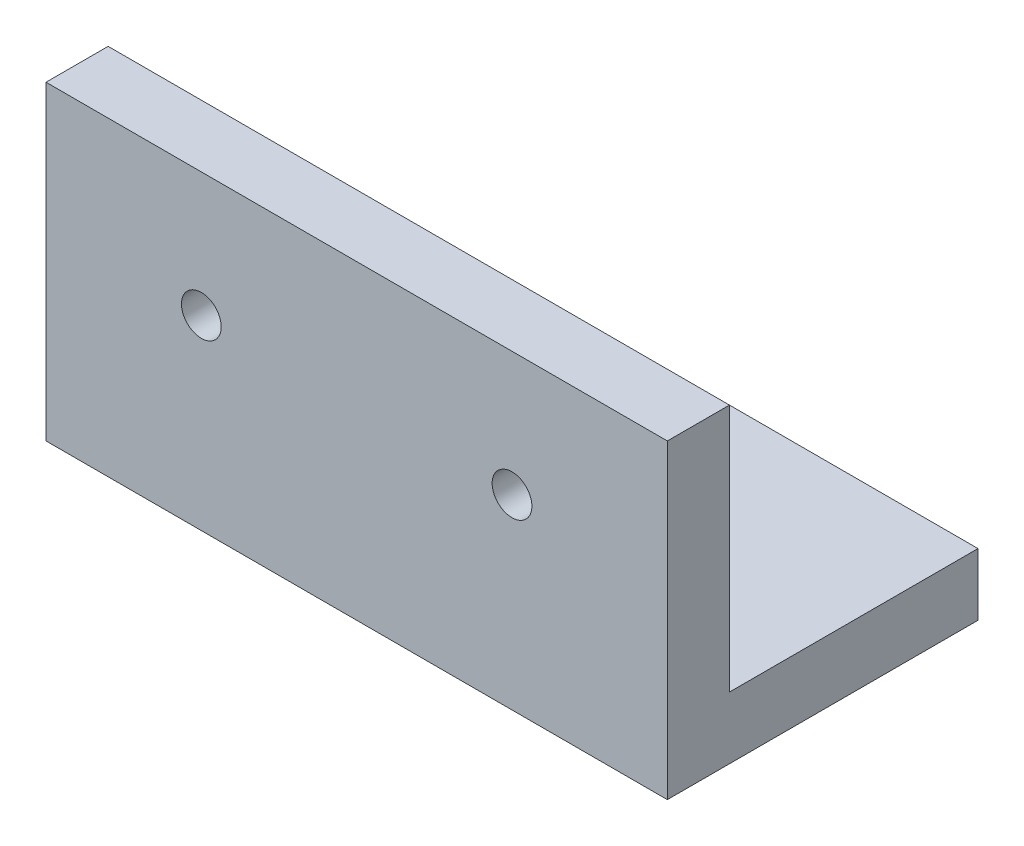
ISO-10303-21;
HEADER;
FILE_DESCRIPTION(('STEP AP214'),'2;1');
FILE_NAME('part.step','',(''),(''),'','','');
FILE_SCHEMA(('AUTOMOTIVE_DESIGN { 1 0 10303 214 1 1 1 1 }'));
ENDSEC;
DATA;
#1=APPLICATION_CONTEXT('core data for automotive mechanical design processes');
#2=APPLICATION_PROTOCOL_DEFINITION('international standard','automotive_design',2000,#1);
#3=PRODUCT_CONTEXT('',#1,'mechanical');
#4=PRODUCT('Part','Part','',(#3));
#5=PRODUCT_RELATED_PRODUCT_CATEGORY('part','',(#4));
#6=PRODUCT_DEFINITION_FORMATION('','',#4);
#7=PRODUCT_DEFINITION_CONTEXT('part definition',#1,'design');
#8=PRODUCT_DEFINITION('design','',#6,#7);
#9=PRODUCT_DEFINITION_SHAPE('','',#8);
#10=(LENGTH_UNIT() NAMED_UNIT(*) SI_UNIT(.MILLI.,.METRE.));
#11=(NAMED_UNIT(*) PLANE_ANGLE_UNIT() SI_UNIT($,.RADIAN.));
#12=(NAMED_UNIT(*) SI_UNIT($,.STERADIAN.) SOLID_ANGLE_UNIT());
#13=UNCERTAINTY_MEASURE_WITH_UNIT(LENGTH_MEASURE(1.E-05),#10,'distance_accuracy_value','');
#14=(GEOMETRIC_REPRESENTATION_CONTEXT(3) GLOBAL_UNCERTAINTY_ASSIGNED_CONTEXT((#13)) GLOBAL_UNIT_ASSIGNED_CONTEXT((#10,
#11,#12)) REPRESENTATION_CONTEXT('',''));
#15=CARTESIAN_POINT('',(0.,0.,0.));
#16=DIRECTION('',(0.,0.,1.));
#17=DIRECTION('',(1.,0.,0.));
#18=AXIS2_PLACEMENT_3D('',#15,#16,#17);
#19=CARTESIAN_POINT('',(0.,5.,0.));
#20=DIRECTION('',(0.,-1.,0.));
#21=DIRECTION('',(0.,0.,-1.));
#22=AXIS2_PLACEMENT_3D('',#19,#20,#21);
#23=PLANE('',#22);
#24=CARTESIAN_POINT('',(18.9814814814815,5.,-15.));
#25=DIRECTION('',(0.,-1.,0.));
#26=DIRECTION('',(0.,0.,1.));
#27=AXIS2_PLACEMENT_3D('',#24,#25,#26);
#28=CIRCLE('',#27,1.6);
#29=CARTESIAN_POINT('',(18.9814814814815,5.,-13.4));
#30=VERTEX_POINT('',#29);
#31=EDGE_CURVE('E150',#30,#30,#28,.T.);
#32=ORIENTED_EDGE('',*,*,#31,.T.);
#33=EDGE_LOOP('',(#32));
#34=FACE_BOUND('',#33,.T.);
#35=CARTESIAN_POINT('',(-6.01851851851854,5.,-15.));
#36=DIRECTION('',(0.,1.,0.));
#37=DIRECTION('',(0.,0.,1.));
#38=AXIS2_PLACEMENT_3D('',#35,#36,#37);
#39=CIRCLE('',#38,1.6);
#40=CARTESIAN_POINT('',(-6.01851851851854,5.,-13.4));
#41=VERTEX_POINT('',#40);
#42=EDGE_CURVE('E144',#41,#41,#39,.T.);
#43=ORIENTED_EDGE('',*,*,#42,.F.);
#44=EDGE_LOOP('',(#43));
#45=FACE_BOUND('',#44,.T.);
#46=DIRECTION('',(-1.,0.,0.));
#47=VECTOR('',#46,1.);
#48=CARTESIAN_POINT('',(31.4814814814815,5.,-5.));
#49=LINE('',#48,#47);
#50=CARTESIAN_POINT('',(31.4814814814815,5.,-5.));
#51=VERTEX_POINT('',#50);
#52=CARTESIAN_POINT('',(-18.5185185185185,5.,-4.99999999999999));
#53=VERTEX_POINT('',#52);
#54=EDGE_CURVE('E48',#51,#53,#49,.T.);
#55=ORIENTED_EDGE('',*,*,#54,.F.);
#56=DIRECTION('',(0.,0.,-1.));
#57=VECTOR('',#56,1.);
#58=CARTESIAN_POINT('',(31.4814814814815,5.,0.));
#59=LINE('',#58,#57);
#60=CARTESIAN_POINT('',(31.4814814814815,5.,-25.));
#61=VERTEX_POINT('',#60);
#62=EDGE_CURVE('E134',#51,#61,#59,.T.);
#63=ORIENTED_EDGE('',*,*,#62,.T.);
#64=DIRECTION('',(-1.,0.,0.));
#65=VECTOR('',#64,1.);
#66=CARTESIAN_POINT('',(-18.5185185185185,5.,-25.));
#67=LINE('',#66,#65);
#68=CARTESIAN_POINT('',(-18.5185185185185,5.,-25.));
#69=VERTEX_POINT('',#68);
#70=EDGE_CURVE('E54',#61,#69,#67,.T.);
#71=ORIENTED_EDGE('',*,*,#70,.T.);
#72=DIRECTION('',(0.,0.,1.));
#73=VECTOR('',#72,1.);
#74=CARTESIAN_POINT('',(-18.5185185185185,5.,0.));
#75=LINE('',#74,#73);
#76=EDGE_CURVE('E83',#69,#53,#75,.T.);
#77=ORIENTED_EDGE('',*,*,#76,.T.);
#78=EDGE_LOOP('',(#55,#63,#71,#77));
#79=FACE_BOUND('',#78,.T.);
#80=ADVANCED_FACE('F33',(#34,#45,#79),#23,.F.);
#81=CARTESIAN_POINT('',(-18.5185185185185,5.,0.));
#82=DIRECTION('',(1.,0.,0.));
#83=DIRECTION('',(0.,0.,-1.));
#84=AXIS2_PLACEMENT_3D('',#81,#82,#83);
#85=PLANE('',#84);
#86=DIRECTION('',(0.,0.,1.));
#87=VECTOR('',#86,1.);
#88=CARTESIAN_POINT('',(-18.5185185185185,0.,0.));
#89=LINE('',#88,#87);
#90=CARTESIAN_POINT('',(-18.5185185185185,0.,-25.));
#91=VERTEX_POINT('',#90);
#92=CARTESIAN_POINT('',(-18.5185185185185,0.,0.));
#93=VERTEX_POINT('',#92);
#94=EDGE_CURVE('E89',#91,#93,#89,.T.);
#95=ORIENTED_EDGE('',*,*,#94,.T.);
#96=DIRECTION('',(0.,-1.,0.));
#97=VECTOR('',#96,1.);
#98=CARTESIAN_POINT('',(-18.5185185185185,5.,0.));
#99=LINE('',#98,#97);
#100=CARTESIAN_POINT('',(-18.5185185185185,25.,0.));
#101=VERTEX_POINT('',#100);
#102=EDGE_CURVE('E11',#101,#93,#99,.T.);
#103=ORIENTED_EDGE('',*,*,#102,.F.);
#104=DIRECTION('',(0.,0.,1.));
#105=VECTOR('',#104,1.);
#106=CARTESIAN_POINT('',(-18.5185185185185,25.,0.));
#107=LINE('',#106,#105);
#108=CARTESIAN_POINT('',(-18.5185185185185,25.,-4.99999999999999));
#109=VERTEX_POINT('',#108);
#110=EDGE_CURVE('E125',#109,#101,#107,.T.);
#111=ORIENTED_EDGE('',*,*,#110,.F.);
#112=DIRECTION('',(0.,-1.,0.));
#113=VECTOR('',#112,1.);
#114=CARTESIAN_POINT('',(-18.5185185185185,25.,-4.99999999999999));
#115=LINE('',#114,#113);
#116=EDGE_CURVE('E98',#109,#53,#115,.T.);
#117=ORIENTED_EDGE('',*,*,#116,.T.);
#118=ORIENTED_EDGE('',*,*,#76,.F.);
#119=DIRECTION('',(0.,-1.,0.));
#120=VECTOR('',#119,1.);
#121=CARTESIAN_POINT('',(-18.5185185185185,5.,-25.));
#122=LINE('',#121,#120);
#123=EDGE_CURVE('E76',#69,#91,#122,.T.);
#124=ORIENTED_EDGE('',*,*,#123,.T.);
#125=EDGE_LOOP('',(#95,#103,#111,#117,#118,#124));
#126=FACE_BOUND('',#125,.T.);
#127=ADVANCED_FACE('F35',(#126),#85,.F.);
#128=CARTESIAN_POINT('',(-18.5185185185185,5.,0.));
#129=DIRECTION('',(0.,0.,-1.));
#130=DIRECTION('',(-1.,0.,0.));
#131=AXIS2_PLACEMENT_3D('',#128,#129,#130);
#132=PLANE('',#131);
#133=CARTESIAN_POINT('',(18.9814814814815,15.,0.));
#134=DIRECTION('',(0.,0.,1.));
#135=DIRECTION('',(1.,0.,0.));
#136=AXIS2_PLACEMENT_3D('',#133,#134,#135);
#137=CIRCLE('',#136,1.6);
#138=CARTESIAN_POINT('',(20.5814814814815,15.,0.));
#139=VERTEX_POINT('',#138);
#140=EDGE_CURVE('E159',#139,#139,#137,.T.);
#141=ORIENTED_EDGE('',*,*,#140,.F.);
#142=EDGE_LOOP('',(#141));
#143=FACE_BOUND('',#142,.T.);
#144=CARTESIAN_POINT('',(-6.01851851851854,15.,0.));
#145=DIRECTION('',(0.,0.,-1.));
#146=DIRECTION('',(-1.,0.,0.));
#147=AXIS2_PLACEMENT_3D('',#144,#145,#146);
#148=CIRCLE('',#147,1.6);
#149=CARTESIAN_POINT('',(-7.61851851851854,15.,0.));
#150=VERTEX_POINT('',#149);
#151=EDGE_CURVE('E153',#150,#150,#148,.T.);
#152=ORIENTED_EDGE('',*,*,#151,.T.);
#153=EDGE_LOOP('',(#152));
#154=FACE_BOUND('',#153,.T.);
#155=DIRECTION('',(1.,0.,0.));
#156=VECTOR('',#155,1.);
#157=CARTESIAN_POINT('',(-18.5185185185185,0.,0.));
#158=LINE('',#157,#156);
#159=CARTESIAN_POINT('',(31.4814814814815,0.,0.));
#160=VERTEX_POINT('',#159);
#161=EDGE_CURVE('E93',#93,#160,#158,.T.);
#162=ORIENTED_EDGE('',*,*,#161,.T.);
#163=DIRECTION('',(0.,-1.,0.));
#164=VECTOR('',#163,1.);
#165=CARTESIAN_POINT('',(31.4814814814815,5.,0.));
#166=LINE('',#165,#164);
#167=CARTESIAN_POINT('',(31.4814814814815,25.,0.));
#168=VERTEX_POINT('',#167);
#169=EDGE_CURVE('E41',#168,#160,#166,.T.);
#170=ORIENTED_EDGE('',*,*,#169,.F.);
#171=DIRECTION('',(1.,0.,0.));
#172=VECTOR('',#171,1.);
#173=CARTESIAN_POINT('',(31.4814814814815,25.,0.));
#174=LINE('',#173,#172);
#175=EDGE_CURVE('E117',#101,#168,#174,.T.);
#176=ORIENTED_EDGE('',*,*,#175,.F.);
#177=ORIENTED_EDGE('',*,*,#102,.T.);
#178=EDGE_LOOP('',(#162,#170,#176,#177));
#179=FACE_BOUND('',#178,.T.);
#180=ADVANCED_FACE('F115',(#143,#154,#179),#132,.F.);
#181=CARTESIAN_POINT('',(31.4814814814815,5.,0.));
#182=DIRECTION('',(-1.,0.,0.));
#183=DIRECTION('',(0.,0.,1.));
#184=AXIS2_PLACEMENT_3D('',#181,#182,#183);
#185=PLANE('',#184);
#186=DIRECTION('',(0.,0.,-1.));
#187=VECTOR('',#186,1.);
#188=CARTESIAN_POINT('',(31.4814814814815,0.,0.));
#189=LINE('',#188,#187);
#190=CARTESIAN_POINT('',(31.4814814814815,0.,-25.));
#191=VERTEX_POINT('',#190);
#192=EDGE_CURVE('E84',#160,#191,#189,.T.);
#193=ORIENTED_EDGE('',*,*,#192,.T.);
#194=DIRECTION('',(0.,-1.,0.));
#195=VECTOR('',#194,1.);
#196=CARTESIAN_POINT('',(31.4814814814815,5.,-25.));
#197=LINE('',#196,#195);
#198=EDGE_CURVE('E79',#61,#191,#197,.T.);
#199=ORIENTED_EDGE('',*,*,#198,.F.);
#200=ORIENTED_EDGE('',*,*,#62,.F.);
#201=DIRECTION('',(0.,-1.,0.));
#202=VECTOR('',#201,1.);
#203=CARTESIAN_POINT('',(31.4814814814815,25.,-5.));
#204=LINE('',#203,#202);
#205=CARTESIAN_POINT('',(31.4814814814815,25.,-5.));
#206=VERTEX_POINT('',#205);
#207=EDGE_CURVE('E94',#206,#51,#204,.T.);
#208=ORIENTED_EDGE('',*,*,#207,.F.);
#209=DIRECTION('',(0.,0.,-1.));
#210=VECTOR('',#209,1.);
#211=CARTESIAN_POINT('',(31.4814814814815,25.,0.));
#212=LINE('',#211,#210);
#213=EDGE_CURVE('E111',#168,#206,#212,.T.);
#214=ORIENTED_EDGE('',*,*,#213,.F.);
#215=ORIENTED_EDGE('',*,*,#169,.T.);
#216=EDGE_LOOP('',(#193,#199,#200,#208,#214,#215));
#217=FACE_BOUND('',#216,.T.);
#218=ADVANCED_FACE('F108',(#217),#185,.F.);
#219=CARTESIAN_POINT('',(-18.5185185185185,5.,-25.));
#220=DIRECTION('',(0.,0.,1.));
#221=DIRECTION('',(1.,0.,0.));
#222=AXIS2_PLACEMENT_3D('',#219,#220,#221);
#223=PLANE('',#222);
#224=DIRECTION('',(-1.,0.,0.));
#225=VECTOR('',#224,1.);
#226=CARTESIAN_POINT('',(-18.5185185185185,0.,-25.));
#227=LINE('',#226,#225);
#228=EDGE_CURVE('E73',#191,#91,#227,.T.);
#229=ORIENTED_EDGE('',*,*,#228,.T.);
#230=ORIENTED_EDGE('',*,*,#123,.F.);
#231=ORIENTED_EDGE('',*,*,#70,.F.);
#232=ORIENTED_EDGE('',*,*,#198,.T.);
#233=EDGE_LOOP('',(#229,#230,#231,#232));
#234=FACE_BOUND('',#233,.T.);
#235=ADVANCED_FACE('F75',(#234),#223,.F.);
#236=CARTESIAN_POINT('',(0.,0.,0.));
#237=DIRECTION('',(0.,-1.,0.));
#238=DIRECTION('',(0.,0.,-1.));
#239=AXIS2_PLACEMENT_3D('',#236,#237,#238);
#240=PLANE('',#239);
#241=CARTESIAN_POINT('',(18.9814814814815,0.,-15.));
#242=DIRECTION('',(0.,-1.,0.));
#243=DIRECTION('',(0.,0.,1.));
#244=AXIS2_PLACEMENT_3D('',#241,#242,#243);
#245=CIRCLE('',#244,1.6);
#246=CARTESIAN_POINT('',(18.9814814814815,0.,-13.4));
#247=VERTEX_POINT('',#246);
#248=EDGE_CURVE('E147',#247,#247,#245,.T.);
#249=ORIENTED_EDGE('',*,*,#248,.F.);
#250=EDGE_LOOP('',(#249));
#251=FACE_BOUND('',#250,.T.);
#252=CARTESIAN_POINT('',(-6.01851851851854,0.,-15.));
#253=DIRECTION('',(0.,1.,0.));
#254=DIRECTION('',(0.,0.,1.));
#255=AXIS2_PLACEMENT_3D('',#252,#253,#254);
#256=CIRCLE('',#255,1.6);
#257=CARTESIAN_POINT('',(-6.01851851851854,0.,-13.4));
#258=VERTEX_POINT('',#257);
#259=EDGE_CURVE('E132',#258,#258,#256,.T.);
#260=ORIENTED_EDGE('',*,*,#259,.T.);
#261=EDGE_LOOP('',(#260));
#262=FACE_BOUND('',#261,.T.);
#263=ORIENTED_EDGE('',*,*,#94,.F.);
#264=ORIENTED_EDGE('',*,*,#228,.F.);
#265=ORIENTED_EDGE('',*,*,#192,.F.);
#266=ORIENTED_EDGE('',*,*,#161,.F.);
#267=EDGE_LOOP('',(#263,#264,#265,#266));
#268=FACE_BOUND('',#267,.T.);
#269=ADVANCED_FACE('F92',(#251,#262,#268),#240,.T.);
#270=CARTESIAN_POINT('',(31.4814814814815,25.,-5.));
#271=DIRECTION('',(0.,0.,1.));
#272=DIRECTION('',(1.,0.,0.));
#273=AXIS2_PLACEMENT_3D('',#270,#271,#272);
#274=PLANE('',#273);
#275=CARTESIAN_POINT('',(18.9814814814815,15.,-4.99999999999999));
#276=DIRECTION('',(0.,0.,1.));
#277=DIRECTION('',(1.,0.,0.));
#278=AXIS2_PLACEMENT_3D('',#275,#276,#277);
#279=CIRCLE('',#278,1.6);
#280=CARTESIAN_POINT('',(20.5814814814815,15.,-4.99999999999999));
#281=VERTEX_POINT('',#280);
#282=EDGE_CURVE('E162',#281,#281,#279,.T.);
#283=ORIENTED_EDGE('',*,*,#282,.T.);
#284=EDGE_LOOP('',(#283));
#285=FACE_BOUND('',#284,.T.);
#286=CARTESIAN_POINT('',(-6.01851851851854,15.,-4.99999999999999));
#287=DIRECTION('',(0.,0.,-1.));
#288=DIRECTION('',(-1.,0.,0.));
#289=AXIS2_PLACEMENT_3D('',#286,#287,#288);
#290=CIRCLE('',#289,1.6);
#291=CARTESIAN_POINT('',(-7.61851851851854,15.,-4.99999999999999));
#292=VERTEX_POINT('',#291);
#293=EDGE_CURVE('E156',#292,#292,#290,.T.);
#294=ORIENTED_EDGE('',*,*,#293,.F.);
#295=EDGE_LOOP('',(#294));
#296=FACE_BOUND('',#295,.T.);
#297=ORIENTED_EDGE('',*,*,#54,.T.);
#298=ORIENTED_EDGE('',*,*,#116,.F.);
#299=DIRECTION('',(-1.,0.,0.));
#300=VECTOR('',#299,1.);
#301=CARTESIAN_POINT('',(31.4814814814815,25.,-5.));
#302=LINE('',#301,#300);
#303=EDGE_CURVE('E128',#206,#109,#302,.T.);
#304=ORIENTED_EDGE('',*,*,#303,.F.);
#305=ORIENTED_EDGE('',*,*,#207,.T.);
#306=EDGE_LOOP('',(#297,#298,#304,#305));
#307=FACE_BOUND('',#306,.T.);
#308=ADVANCED_FACE('F137',(#285,#296,#307),#274,.F.);
#309=CARTESIAN_POINT('',(0.,25.,0.));
#310=DIRECTION('',(0.,1.,0.));
#311=DIRECTION('',(0.,0.,1.));
#312=AXIS2_PLACEMENT_3D('',#309,#310,#311);
#313=PLANE('',#312);
#314=ORIENTED_EDGE('',*,*,#213,.T.);
#315=ORIENTED_EDGE('',*,*,#303,.T.);
#316=ORIENTED_EDGE('',*,*,#110,.T.);
#317=ORIENTED_EDGE('',*,*,#175,.T.);
#318=EDGE_LOOP('',(#314,#315,#316,#317));
#319=FACE_BOUND('',#318,.T.);
#320=ADVANCED_FACE('F121',(#319),#313,.T.);
#321=CARTESIAN_POINT('',(-6.01851851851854,0.,-15.));
#322=DIRECTION('',(0.,1.,0.));
#323=DIRECTION('',(0.,0.,1.));
#324=AXIS2_PLACEMENT_3D('',#321,#322,#323);
#325=CYLINDRICAL_SURFACE('',#324,1.6);
#326=ORIENTED_EDGE('',*,*,#259,.F.);
#327=EDGE_LOOP('',(#326));
#328=FACE_BOUND('',#327,.T.);
#329=ORIENTED_EDGE('',*,*,#42,.T.);
#330=EDGE_LOOP('',(#329));
#331=FACE_BOUND('',#330,.T.);
#332=ADVANCED_FACE('F189',(#328,#331),#325,.F.);
#333=CARTESIAN_POINT('',(18.9814814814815,0.,-15.));
#334=DIRECTION('',(0.,1.,0.));
#335=DIRECTION('',(0.,0.,1.));
#336=AXIS2_PLACEMENT_3D('',#333,#334,#335);
#337=CYLINDRICAL_SURFACE('',#336,1.6);
#338=ORIENTED_EDGE('',*,*,#248,.T.);
#339=EDGE_LOOP('',(#338));
#340=FACE_BOUND('',#339,.T.);
#341=ORIENTED_EDGE('',*,*,#31,.F.);
#342=EDGE_LOOP('',(#341));
#343=FACE_BOUND('',#342,.T.);
#344=ADVANCED_FACE('F178',(#340,#343),#337,.F.);
#345=CARTESIAN_POINT('',(-6.01851851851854,15.,0.));
#346=DIRECTION('',(0.,0.,-1.));
#347=DIRECTION('',(-1.,0.,0.));
#348=AXIS2_PLACEMENT_3D('',#345,#346,#347);
#349=CYLINDRICAL_SURFACE('',#348,1.6);
#350=ORIENTED_EDGE('',*,*,#151,.F.);
#351=EDGE_LOOP('',(#350));
#352=FACE_BOUND('',#351,.T.);
#353=ORIENTED_EDGE('',*,*,#293,.T.);
#354=EDGE_LOOP('',(#353));
#355=FACE_BOUND('',#354,.T.);
#356=ADVANCED_FACE('F175',(#352,#355),#349,.F.);
#357=CARTESIAN_POINT('',(18.9814814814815,15.,0.));
#358=DIRECTION('',(0.,0.,-1.));
#359=DIRECTION('',(-1.,0.,0.));
#360=AXIS2_PLACEMENT_3D('',#357,#358,#359);
#361=CYLINDRICAL_SURFACE('',#360,1.6);
#362=ORIENTED_EDGE('',*,*,#140,.T.);
#363=EDGE_LOOP('',(#362));
#364=FACE_BOUND('',#363,.T.);
#365=ORIENTED_EDGE('',*,*,#282,.F.);
#366=EDGE_LOOP('',(#365));
#367=FACE_BOUND('',#366,.T.);
#368=ADVANCED_FACE('F168',(#364,#367),#361,.F.);
#369=CLOSED_SHELL('',(#80,#127,#180,#218,#235,#269,#308,#320,#332,#344,#356,#368));
#370=MANIFOLD_SOLID_BREP('B2',#369);
#371=ADVANCED_BREP_SHAPE_REPRESENTATION('',(#18,#370),#14);
#372=SHAPE_DEFINITION_REPRESENTATION(#9,#371);
ENDSEC;
END-ISO-10303-21;
